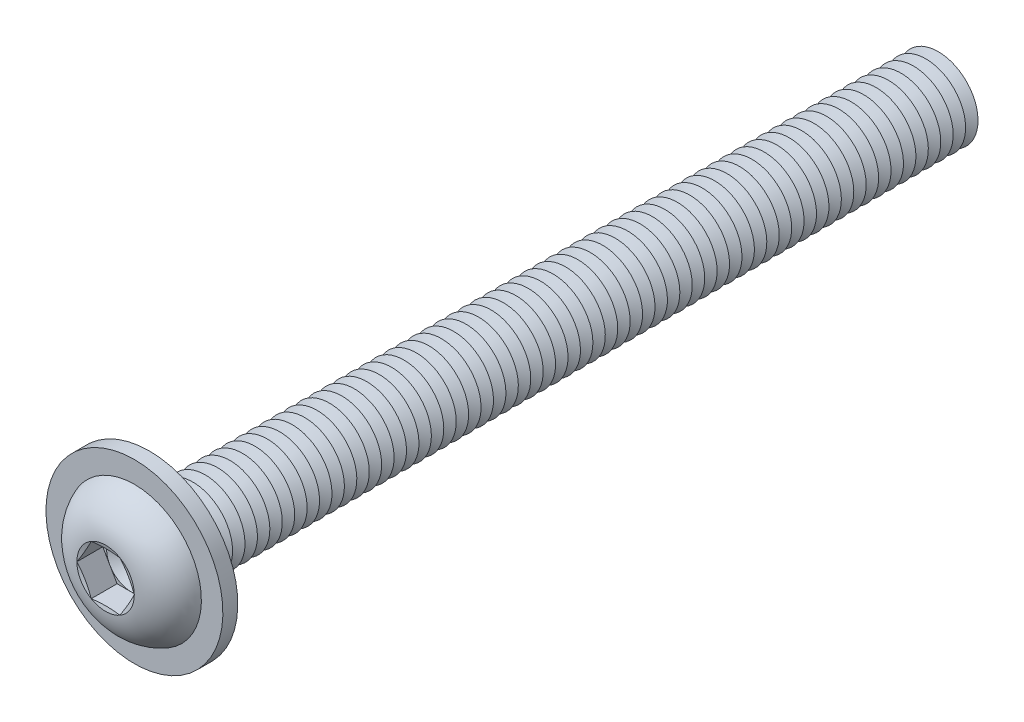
from build123d import *

# Parameters (mm, degrees)
FILLET1_R           = 0.625
LPATTERN1_COUNT     = 64
LPATTERN1_PITCH     = 1.25
CUT_EXTRUDE1_DEPTH  = 2.6
SKETCH5_R           = 8.9
SKETCH5_R_2         = 4.625
BOSS_EXTRUDE1_DEPTH = 1.5


with BuildPart() as part:
    # Sketch1 → Revolve1 (revolve)
    with BuildSketch(Plane(origin=(0, 0, 0), x_dir=(0, 0, -1), z_dir=(1, 0, 0))):
        with BuildLine():
            Line((0, 4), (0, 7))
            ThreePointArc((0, 7), (-3.011595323, 5.81154966), (-4.4, 2.88675))
            Line((-4.4, 2.88675), (-4.013248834, 1.443375))
            Line((-4.013248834, 1.443375), (-4.4, 1.443375))
            Line((-4.4, 1.443375), (-4.4, 0))
            Line((-4.4, 0), (80, 0))
            Line((80, 0), (80, 4))
            Line((80, 4), (0, 4))
        make_face()
    revolve(axis=Axis((0, 0, -80), (0, 0, 1)))

    # Fillet1
    fillet1_edges = [part.edges().sort_by_distance(p)[0] for p in [
        (0, -4, 0),
    ]]
    fillet(fillet1_edges, radius=FILLET1_R)

    # Sketch2 → Cut-Revolve1 (revolve, cut)
    with BuildSketch(Plane(origin=(0, 0, 0), x_dir=(0, 0, -1), z_dir=(1, 0, 0))):
        Polygon((79.375, 4), (80.625, 4), (80, 2.917468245), align=None)
    cut_revolve1 = revolve(axis=Axis((0, 0, -80), (0, 0, -1)), mode=Mode.SUBTRACT)

    # LPattern1: Cut-Revolve1 ×64
    with Locations(*[(0, 0, i * LPATTERN1_PITCH) for i in range(1, LPATTERN1_COUNT)]):
        add(cut_revolve1, mode=Mode.SUBTRACT)

    # Sketch3 → Cut-Extrude1 (cut)
    with BuildSketch(Plane.XY.offset(4.4)):
        Polygon((1.443375, 2.499998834), (-1.443375, 2.499998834), (-2.88675, 0), (-1.443375, -2.499998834), (1.443375, -2.499998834), (2.88675, 0), align=None)
    extrude(amount=-CUT_EXTRUDE1_DEPTH, mode=Mode.SUBTRACT)

    # Cut-Extrude2 cone 1 section (on through the dimple's axis) → Cut-Extrude2 (revolve, cut)
    with BuildSketch(Plane(origin=(0, 0, 1.8), x_dir=(0, -1, 0), z_dir=(1, 0, 0))):
        Polygon((0, 0), (2.499998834, 0), (0, 1.443375), align=None)
    revolve(axis=Axis((0, 0, 1.8), (0, 0, -1)), mode=Mode.SUBTRACT)

    # Sketch5 → Boss-Extrude1 (add)
    with BuildSketch(Plane(origin=(0, 0, 0), x_dir=(-1, 0, 0), z_dir=(0, 0, -1))):
        with Locations(Location((0, 0, 0), (0, 0, 90))):
            Circle(SKETCH5_R)
        Circle(SKETCH5_R_2, mode=Mode.SUBTRACT)
    extrude(amount=-BOSS_EXTRUDE1_DEPTH)


solid = part.part
